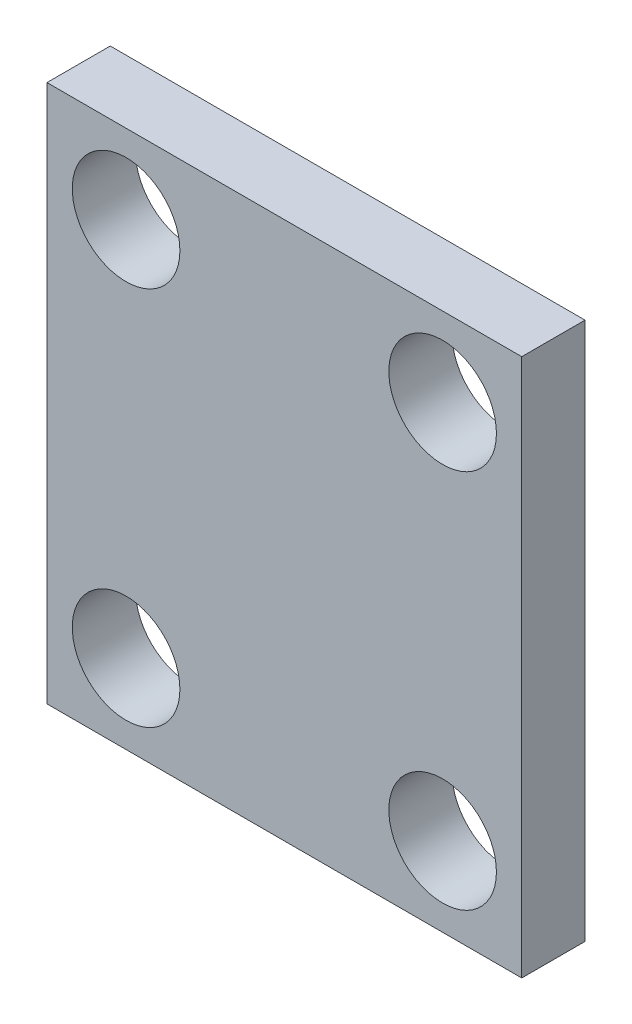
ISO-10303-21;
HEADER;
FILE_DESCRIPTION(('STEP AP214'),'2;1');
FILE_NAME('part.step','',(''),(''),'','','');
FILE_SCHEMA(('AUTOMOTIVE_DESIGN { 1 0 10303 214 1 1 1 1 }'));
ENDSEC;
DATA;
#1=APPLICATION_CONTEXT('core data for automotive mechanical design processes');
#2=APPLICATION_PROTOCOL_DEFINITION('international standard','automotive_design',2000,#1);
#3=PRODUCT_CONTEXT('',#1,'mechanical');
#4=PRODUCT('Part','Part','',(#3));
#5=PRODUCT_RELATED_PRODUCT_CATEGORY('part','',(#4));
#6=PRODUCT_DEFINITION_FORMATION('','',#4);
#7=PRODUCT_DEFINITION_CONTEXT('part definition',#1,'design');
#8=PRODUCT_DEFINITION('design','',#6,#7);
#9=PRODUCT_DEFINITION_SHAPE('','',#8);
#10=(LENGTH_UNIT() NAMED_UNIT(*) SI_UNIT(.MILLI.,.METRE.));
#11=(NAMED_UNIT(*) PLANE_ANGLE_UNIT() SI_UNIT($,.RADIAN.));
#12=(NAMED_UNIT(*) SI_UNIT($,.STERADIAN.) SOLID_ANGLE_UNIT());
#13=UNCERTAINTY_MEASURE_WITH_UNIT(LENGTH_MEASURE(1.E-05),#10,'distance_accuracy_value','');
#14=(GEOMETRIC_REPRESENTATION_CONTEXT(3) GLOBAL_UNCERTAINTY_ASSIGNED_CONTEXT((#13)) GLOBAL_UNIT_ASSIGNED_CONTEXT((#10,
#11,#12)) REPRESENTATION_CONTEXT('',''));
#15=CARTESIAN_POINT('',(0.,0.,0.));
#16=DIRECTION('',(0.,0.,1.));
#17=DIRECTION('',(1.,0.,0.));
#18=AXIS2_PLACEMENT_3D('',#15,#16,#17);
#19=CARTESIAN_POINT('',(0.,0.,2.));
#20=DIRECTION('',(1.,0.,0.));
#21=DIRECTION('',(0.,0.,-1.));
#22=AXIS2_PLACEMENT_3D('',#19,#20,#21);
#23=PLANE('',#22);
#24=DIRECTION('',(0.,-1.,0.));
#25=VECTOR('',#24,1.);
#26=CARTESIAN_POINT('',(0.,0.,0.));
#27=LINE('',#26,#25);
#28=CARTESIAN_POINT('',(0.,17.,0.));
#29=VERTEX_POINT('',#28);
#30=CARTESIAN_POINT('',(0.,0.,0.));
#31=VERTEX_POINT('',#30);
#32=EDGE_CURVE('E80',#29,#31,#27,.T.);
#33=ORIENTED_EDGE('',*,*,#32,.T.);
#34=DIRECTION('',(0.,0.,-1.));
#35=VECTOR('',#34,1.);
#36=CARTESIAN_POINT('',(0.,0.,2.));
#37=LINE('',#36,#35);
#38=CARTESIAN_POINT('',(0.,0.,2.));
#39=VERTEX_POINT('',#38);
#40=EDGE_CURVE('E87',#39,#31,#37,.T.);
#41=ORIENTED_EDGE('',*,*,#40,.F.);
#42=DIRECTION('',(0.,-1.,0.));
#43=VECTOR('',#42,1.);
#44=CARTESIAN_POINT('',(0.,0.,2.));
#45=LINE('',#44,#43);
#46=CARTESIAN_POINT('',(0.,17.,2.));
#47=VERTEX_POINT('',#46);
#48=EDGE_CURVE('E107',#47,#39,#45,.T.);
#49=ORIENTED_EDGE('',*,*,#48,.F.);
#50=DIRECTION('',(0.,0.,-1.));
#51=VECTOR('',#50,1.);
#52=CARTESIAN_POINT('',(0.,17.,2.));
#53=LINE('',#52,#51);
#54=EDGE_CURVE('E96',#47,#29,#53,.T.);
#55=ORIENTED_EDGE('',*,*,#54,.T.);
#56=EDGE_LOOP('',(#33,#41,#49,#55));
#57=FACE_BOUND('',#56,.T.);
#58=ADVANCED_FACE('F33',(#57),#23,.F.);
#59=CARTESIAN_POINT('',(0.,0.,2.));
#60=DIRECTION('',(0.,1.,0.));
#61=DIRECTION('',(0.,0.,1.));
#62=AXIS2_PLACEMENT_3D('',#59,#60,#61);
#63=PLANE('',#62);
#64=DIRECTION('',(1.,0.,0.));
#65=VECTOR('',#64,1.);
#66=CARTESIAN_POINT('',(0.,0.,0.));
#67=LINE('',#66,#65);
#68=CARTESIAN_POINT('',(15.,0.,0.));
#69=VERTEX_POINT('',#68);
#70=EDGE_CURVE('E74',#31,#69,#67,.T.);
#71=ORIENTED_EDGE('',*,*,#70,.T.);
#72=DIRECTION('',(0.,0.,-1.));
#73=VECTOR('',#72,1.);
#74=CARTESIAN_POINT('',(15.,0.,2.));
#75=LINE('',#74,#73);
#76=CARTESIAN_POINT('',(15.,0.,2.));
#77=VERTEX_POINT('',#76);
#78=EDGE_CURVE('E93',#77,#69,#75,.T.);
#79=ORIENTED_EDGE('',*,*,#78,.F.);
#80=DIRECTION('',(1.,0.,0.));
#81=VECTOR('',#80,1.);
#82=CARTESIAN_POINT('',(0.,0.,2.));
#83=LINE('',#82,#81);
#84=EDGE_CURVE('E89',#39,#77,#83,.T.);
#85=ORIENTED_EDGE('',*,*,#84,.F.);
#86=ORIENTED_EDGE('',*,*,#40,.T.);
#87=EDGE_LOOP('',(#71,#79,#85,#86));
#88=FACE_BOUND('',#87,.T.);
#89=ADVANCED_FACE('F88',(#88),#63,.F.);
#90=CARTESIAN_POINT('',(15.,0.,2.));
#91=DIRECTION('',(-1.,0.,0.));
#92=DIRECTION('',(0.,0.,1.));
#93=AXIS2_PLACEMENT_3D('',#90,#91,#92);
#94=PLANE('',#93);
#95=DIRECTION('',(0.,1.,0.));
#96=VECTOR('',#95,1.);
#97=CARTESIAN_POINT('',(15.,0.,0.));
#98=LINE('',#97,#96);
#99=CARTESIAN_POINT('',(15.,17.,0.));
#100=VERTEX_POINT('',#99);
#101=EDGE_CURVE('E81',#69,#100,#98,.T.);
#102=ORIENTED_EDGE('',*,*,#101,.T.);
#103=DIRECTION('',(0.,0.,-1.));
#104=VECTOR('',#103,1.);
#105=CARTESIAN_POINT('',(15.,17.,2.));
#106=LINE('',#105,#104);
#107=CARTESIAN_POINT('',(15.,17.,2.));
#108=VERTEX_POINT('',#107);
#109=EDGE_CURVE('E113',#108,#100,#106,.T.);
#110=ORIENTED_EDGE('',*,*,#109,.F.);
#111=DIRECTION('',(0.,1.,0.));
#112=VECTOR('',#111,1.);
#113=CARTESIAN_POINT('',(15.,0.,2.));
#114=LINE('',#113,#112);
#115=EDGE_CURVE('E53',#77,#108,#114,.T.);
#116=ORIENTED_EDGE('',*,*,#115,.F.);
#117=ORIENTED_EDGE('',*,*,#78,.T.);
#118=EDGE_LOOP('',(#102,#110,#116,#117));
#119=FACE_BOUND('',#118,.T.);
#120=ADVANCED_FACE('F142',(#119),#94,.F.);
#121=CARTESIAN_POINT('',(0.,17.,2.));
#122=DIRECTION('',(0.,-1.,0.));
#123=DIRECTION('',(0.,0.,-1.));
#124=AXIS2_PLACEMENT_3D('',#121,#122,#123);
#125=PLANE('',#124);
#126=DIRECTION('',(-1.,0.,0.));
#127=VECTOR('',#126,1.);
#128=CARTESIAN_POINT('',(0.,17.,0.));
#129=LINE('',#128,#127);
#130=EDGE_CURVE('E105',#100,#29,#129,.T.);
#131=ORIENTED_EDGE('',*,*,#130,.T.);
#132=ORIENTED_EDGE('',*,*,#54,.F.);
#133=DIRECTION('',(-1.,0.,0.));
#134=VECTOR('',#133,1.);
#135=CARTESIAN_POINT('',(0.,17.,2.));
#136=LINE('',#135,#134);
#137=EDGE_CURVE('E48',#108,#47,#136,.T.);
#138=ORIENTED_EDGE('',*,*,#137,.F.);
#139=ORIENTED_EDGE('',*,*,#109,.T.);
#140=EDGE_LOOP('',(#131,#132,#138,#139));
#141=FACE_BOUND('',#140,.T.);
#142=ADVANCED_FACE('F132',(#141),#125,.F.);
#143=CARTESIAN_POINT('',(0.,17.,2.));
#144=DIRECTION('',(0.,0.,-1.));
#145=DIRECTION('',(-1.,0.,0.));
#146=AXIS2_PLACEMENT_3D('',#143,#144,#145);
#147=PLANE('',#146);
#148=CARTESIAN_POINT('',(12.5,14.5,2.));
#149=DIRECTION('',(0.,0.,1.));
#150=DIRECTION('',(1.,0.,0.));
#151=AXIS2_PLACEMENT_3D('',#148,#149,#150);
#152=CIRCLE('',#151,1.69999999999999);
#153=CARTESIAN_POINT('',(14.2,14.5,2.));
#154=VERTEX_POINT('',#153);
#155=EDGE_CURVE('E176',#154,#154,#152,.T.);
#156=ORIENTED_EDGE('',*,*,#155,.F.);
#157=EDGE_LOOP('',(#156));
#158=FACE_BOUND('',#157,.T.);
#159=CARTESIAN_POINT('',(2.5,14.5,2.));
#160=DIRECTION('',(0.,0.,1.));
#161=DIRECTION('',(1.,0.,0.));
#162=AXIS2_PLACEMENT_3D('',#159,#160,#161);
#163=CIRCLE('',#162,1.69999999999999);
#164=CARTESIAN_POINT('',(4.19999999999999,14.5,2.));
#165=VERTEX_POINT('',#164);
#166=EDGE_CURVE('E100',#165,#165,#163,.T.);
#167=ORIENTED_EDGE('',*,*,#166,.F.);
#168=EDGE_LOOP('',(#167));
#169=FACE_BOUND('',#168,.T.);
#170=ORIENTED_EDGE('',*,*,#48,.T.);
#171=ORIENTED_EDGE('',*,*,#84,.T.);
#172=ORIENTED_EDGE('',*,*,#115,.T.);
#173=ORIENTED_EDGE('',*,*,#137,.T.);
#174=EDGE_LOOP('',(#170,#171,#172,#173));
#175=FACE_BOUND('',#174,.T.);
#176=CARTESIAN_POINT('',(2.5,2.5,2.));
#177=DIRECTION('',(0.,0.,1.));
#178=DIRECTION('',(1.,0.,0.));
#179=AXIS2_PLACEMENT_3D('',#176,#177,#178);
#180=CIRCLE('',#179,1.69999999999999);
#181=CARTESIAN_POINT('',(4.19999999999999,2.5,2.));
#182=VERTEX_POINT('',#181);
#183=EDGE_CURVE('E119',#182,#182,#180,.T.);
#184=ORIENTED_EDGE('',*,*,#183,.F.);
#185=EDGE_LOOP('',(#184));
#186=FACE_BOUND('',#185,.T.);
#187=CARTESIAN_POINT('',(12.5,2.5,2.));
#188=DIRECTION('',(0.,0.,1.));
#189=DIRECTION('',(1.,0.,0.));
#190=AXIS2_PLACEMENT_3D('',#187,#188,#189);
#191=CIRCLE('',#190,1.69999999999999);
#192=CARTESIAN_POINT('',(14.2,2.5,2.));
#193=VERTEX_POINT('',#192);
#194=EDGE_CURVE('E11',#193,#193,#191,.T.);
#195=ORIENTED_EDGE('',*,*,#194,.F.);
#196=EDGE_LOOP('',(#195));
#197=FACE_BOUND('',#196,.T.);
#198=ADVANCED_FACE('F130',(#158,#169,#175,#186,#197),#147,.F.);
#199=CARTESIAN_POINT('',(0.,17.,0.));
#200=DIRECTION('',(0.,0.,-1.));
#201=DIRECTION('',(-1.,0.,0.));
#202=AXIS2_PLACEMENT_3D('',#199,#200,#201);
#203=PLANE('',#202);
#204=CARTESIAN_POINT('',(12.5,14.5,0.));
#205=DIRECTION('',(0.,0.,1.));
#206=DIRECTION('',(1.,0.,0.));
#207=AXIS2_PLACEMENT_3D('',#204,#205,#206);
#208=CIRCLE('',#207,1.7);
#209=CARTESIAN_POINT('',(14.2,14.5,0.));
#210=VERTEX_POINT('',#209);
#211=EDGE_CURVE('E174',#210,#210,#208,.T.);
#212=ORIENTED_EDGE('',*,*,#211,.T.);
#213=EDGE_LOOP('',(#212));
#214=FACE_BOUND('',#213,.T.);
#215=CARTESIAN_POINT('',(2.5,14.5,0.));
#216=DIRECTION('',(0.,0.,1.));
#217=DIRECTION('',(1.,0.,0.));
#218=AXIS2_PLACEMENT_3D('',#215,#216,#217);
#219=CIRCLE('',#218,1.7);
#220=CARTESIAN_POINT('',(4.2,14.5,0.));
#221=VERTEX_POINT('',#220);
#222=EDGE_CURVE('E97',#221,#221,#219,.T.);
#223=ORIENTED_EDGE('',*,*,#222,.T.);
#224=EDGE_LOOP('',(#223));
#225=FACE_BOUND('',#224,.T.);
#226=ORIENTED_EDGE('',*,*,#32,.F.);
#227=ORIENTED_EDGE('',*,*,#130,.F.);
#228=ORIENTED_EDGE('',*,*,#101,.F.);
#229=ORIENTED_EDGE('',*,*,#70,.F.);
#230=EDGE_LOOP('',(#226,#227,#228,#229));
#231=FACE_BOUND('',#230,.T.);
#232=CARTESIAN_POINT('',(2.5,2.5,0.));
#233=DIRECTION('',(0.,0.,1.));
#234=DIRECTION('',(1.,0.,0.));
#235=AXIS2_PLACEMENT_3D('',#232,#233,#234);
#236=CIRCLE('',#235,1.7);
#237=CARTESIAN_POINT('',(4.2,2.5,0.));
#238=VERTEX_POINT('',#237);
#239=EDGE_CURVE('E92',#238,#238,#236,.T.);
#240=ORIENTED_EDGE('',*,*,#239,.T.);
#241=EDGE_LOOP('',(#240));
#242=FACE_BOUND('',#241,.T.);
#243=CARTESIAN_POINT('',(12.5,2.5,0.));
#244=DIRECTION('',(0.,0.,1.));
#245=DIRECTION('',(1.,0.,0.));
#246=AXIS2_PLACEMENT_3D('',#243,#244,#245);
#247=CIRCLE('',#246,1.7);
#248=CARTESIAN_POINT('',(14.2,2.5,0.));
#249=VERTEX_POINT('',#248);
#250=EDGE_CURVE('E41',#249,#249,#247,.T.);
#251=ORIENTED_EDGE('',*,*,#250,.T.);
#252=EDGE_LOOP('',(#251));
#253=FACE_BOUND('',#252,.T.);
#254=ADVANCED_FACE('F76',(#214,#225,#231,#242,#253),#203,.T.);
#255=CARTESIAN_POINT('',(2.5,14.5,2.));
#256=DIRECTION('',(0.,0.,1.));
#257=DIRECTION('',(1.,0.,0.));
#258=AXIS2_PLACEMENT_3D('',#255,#256,#257);
#259=CYLINDRICAL_SURFACE('',#258,1.69999999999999);
#260=ORIENTED_EDGE('',*,*,#222,.F.);
#261=EDGE_LOOP('',(#260));
#262=FACE_BOUND('',#261,.T.);
#263=ORIENTED_EDGE('',*,*,#166,.T.);
#264=EDGE_LOOP('',(#263));
#265=FACE_BOUND('',#264,.T.);
#266=ADVANCED_FACE('F139',(#262,#265),#259,.F.);
#267=CARTESIAN_POINT('',(12.5,14.5,2.));
#268=DIRECTION('',(0.,0.,1.));
#269=DIRECTION('',(1.,0.,0.));
#270=AXIS2_PLACEMENT_3D('',#267,#268,#269);
#271=CYLINDRICAL_SURFACE('',#270,1.69999999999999);
#272=ORIENTED_EDGE('',*,*,#211,.F.);
#273=EDGE_LOOP('',(#272));
#274=FACE_BOUND('',#273,.T.);
#275=ORIENTED_EDGE('',*,*,#155,.T.);
#276=EDGE_LOOP('',(#275));
#277=FACE_BOUND('',#276,.T.);
#278=ADVANCED_FACE('F155',(#274,#277),#271,.F.);
#279=CARTESIAN_POINT('',(2.5,2.5,2.));
#280=DIRECTION('',(0.,0.,1.));
#281=DIRECTION('',(1.,0.,0.));
#282=AXIS2_PLACEMENT_3D('',#279,#280,#281);
#283=CYLINDRICAL_SURFACE('',#282,1.69999999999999);
#284=ORIENTED_EDGE('',*,*,#239,.F.);
#285=EDGE_LOOP('',(#284));
#286=FACE_BOUND('',#285,.T.);
#287=ORIENTED_EDGE('',*,*,#183,.T.);
#288=EDGE_LOOP('',(#287));
#289=FACE_BOUND('',#288,.T.);
#290=ADVANCED_FACE('F127',(#286,#289),#283,.F.);
#291=CARTESIAN_POINT('',(12.5,2.5,2.));
#292=DIRECTION('',(0.,0.,1.));
#293=DIRECTION('',(1.,0.,0.));
#294=AXIS2_PLACEMENT_3D('',#291,#292,#293);
#295=CYLINDRICAL_SURFACE('',#294,1.69999999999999);
#296=ORIENTED_EDGE('',*,*,#250,.F.);
#297=EDGE_LOOP('',(#296));
#298=FACE_BOUND('',#297,.T.);
#299=ORIENTED_EDGE('',*,*,#194,.T.);
#300=EDGE_LOOP('',(#299));
#301=FACE_BOUND('',#300,.T.);
#302=ADVANCED_FACE('F35',(#298,#301),#295,.F.);
#303=CLOSED_SHELL('',(#58,#89,#120,#142,#198,#254,#266,#278,#290,#302));
#304=MANIFOLD_SOLID_BREP('B2',#303);
#305=ADVANCED_BREP_SHAPE_REPRESENTATION('',(#18,#304),#14);
#306=SHAPE_DEFINITION_REPRESENTATION(#9,#305);
ENDSEC;
END-ISO-10303-21;
